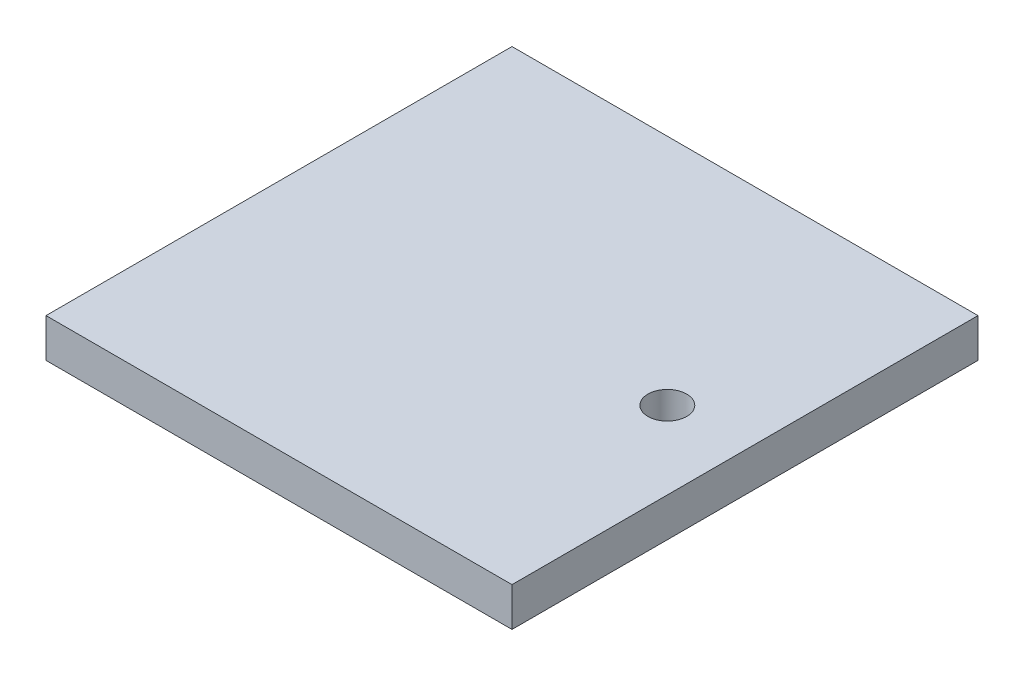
ISO-10303-21;
HEADER;
FILE_DESCRIPTION(('STEP AP214'),'2;1');
FILE_NAME('part.step','',(''),(''),'','','');
FILE_SCHEMA(('AUTOMOTIVE_DESIGN { 1 0 10303 214 1 1 1 1 }'));
ENDSEC;
DATA;
#1=APPLICATION_CONTEXT('core data for automotive mechanical design processes');
#2=APPLICATION_PROTOCOL_DEFINITION('international standard','automotive_design',2000,#1);
#3=PRODUCT_CONTEXT('',#1,'mechanical');
#4=PRODUCT('Part','Part','',(#3));
#5=PRODUCT_RELATED_PRODUCT_CATEGORY('part','',(#4));
#6=PRODUCT_DEFINITION_FORMATION('','',#4);
#7=PRODUCT_DEFINITION_CONTEXT('part definition',#1,'design');
#8=PRODUCT_DEFINITION('design','',#6,#7);
#9=PRODUCT_DEFINITION_SHAPE('','',#8);
#10=(LENGTH_UNIT() NAMED_UNIT(*) SI_UNIT(.MILLI.,.METRE.));
#11=(NAMED_UNIT(*) PLANE_ANGLE_UNIT() SI_UNIT($,.RADIAN.));
#12=(NAMED_UNIT(*) SI_UNIT($,.STERADIAN.) SOLID_ANGLE_UNIT());
#13=UNCERTAINTY_MEASURE_WITH_UNIT(LENGTH_MEASURE(1.E-05),#10,'distance_accuracy_value','');
#14=(GEOMETRIC_REPRESENTATION_CONTEXT(3) GLOBAL_UNCERTAINTY_ASSIGNED_CONTEXT((#13)) GLOBAL_UNIT_ASSIGNED_CONTEXT((#10,
#11,#12)) REPRESENTATION_CONTEXT('',''));
#15=CARTESIAN_POINT('',(0.,0.,0.));
#16=DIRECTION('',(0.,0.,1.));
#17=DIRECTION('',(1.,0.,0.));
#18=AXIS2_PLACEMENT_3D('',#15,#16,#17);
#19=CARTESIAN_POINT('',(-35.5740420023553,6.35,13.4217081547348));
#20=DIRECTION('',(0.,1.,0.));
#21=DIRECTION('',(0.,0.,1.));
#22=AXIS2_PLACEMENT_3D('',#19,#20,#21);
#23=PLANE('',#22);
#24=DIRECTION('',(0.,0.,1.));
#25=VECTOR('',#24,1.);
#26=CARTESIAN_POINT('',(-35.5740420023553,6.35,-62.7782918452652));
#27=LINE('',#26,#25);
#28=CARTESIAN_POINT('',(-35.5740420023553,6.35,-62.7782918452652));
#29=VERTEX_POINT('',#28);
#30=CARTESIAN_POINT('',(-35.5740420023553,6.35,13.4217081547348));
#31=VERTEX_POINT('',#30);
#32=EDGE_CURVE('E83',#29,#31,#27,.T.);
#33=ORIENTED_EDGE('',*,*,#32,.T.);
#34=DIRECTION('',(1.,0.,0.));
#35=VECTOR('',#34,1.);
#36=CARTESIAN_POINT('',(-35.5740420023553,6.35,13.4217081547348));
#37=LINE('',#36,#35);
#38=CARTESIAN_POINT('',(40.6259579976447,6.35,13.4217081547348));
#39=VERTEX_POINT('',#38);
#40=EDGE_CURVE('E78',#31,#39,#37,.T.);
#41=ORIENTED_EDGE('',*,*,#40,.T.);
#42=DIRECTION('',(0.,0.,-1.));
#43=VECTOR('',#42,1.);
#44=CARTESIAN_POINT('',(40.6259579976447,6.35,-62.7782918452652));
#45=LINE('',#44,#43);
#46=CARTESIAN_POINT('',(40.6259579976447,6.35,-62.7782918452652));
#47=VERTEX_POINT('',#46);
#48=EDGE_CURVE('E81',#39,#47,#45,.T.);
#49=ORIENTED_EDGE('',*,*,#48,.T.);
#50=DIRECTION('',(-1.,0.,0.));
#51=VECTOR('',#50,1.);
#52=CARTESIAN_POINT('',(-35.5740420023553,6.35,-62.7782918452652));
#53=LINE('',#52,#51);
#54=EDGE_CURVE('E48',#47,#29,#53,.T.);
#55=ORIENTED_EDGE('',*,*,#54,.T.);
#56=EDGE_LOOP('',(#33,#41,#49,#55));
#57=FACE_BOUND('',#56,.T.);
#58=CARTESIAN_POINT('',(27.9259579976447,6.35,-24.6782918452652));
#59=DIRECTION('',(0.,1.,0.));
#60=DIRECTION('',(0.,0.,1.));
#61=AXIS2_PLACEMENT_3D('',#58,#59,#60);
#62=CIRCLE('',#61,3.175);
#63=CARTESIAN_POINT('',(27.9259579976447,6.35,-21.5032918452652));
#64=VERTEX_POINT('',#63);
#65=EDGE_CURVE('E98',#64,#64,#62,.T.);
#66=ORIENTED_EDGE('',*,*,#65,.F.);
#67=EDGE_LOOP('',(#66));
#68=FACE_BOUND('',#67,.T.);
#69=ADVANCED_FACE('F31',(#57,#68),#23,.T.);
#70=CARTESIAN_POINT('',(-35.5740420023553,0.,13.4217081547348));
#71=DIRECTION('',(0.,1.,0.));
#72=DIRECTION('',(0.,0.,1.));
#73=AXIS2_PLACEMENT_3D('',#70,#71,#72);
#74=PLANE('',#73);
#75=DIRECTION('',(0.,0.,1.));
#76=VECTOR('',#75,1.);
#77=CARTESIAN_POINT('',(-35.5740420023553,0.,-62.7782918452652));
#78=LINE('',#77,#76);
#79=CARTESIAN_POINT('',(-35.5740420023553,0.,-62.7782918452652));
#80=VERTEX_POINT('',#79);
#81=CARTESIAN_POINT('',(-35.5740420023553,0.,13.4217081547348));
#82=VERTEX_POINT('',#81);
#83=EDGE_CURVE('E95',#80,#82,#78,.T.);
#84=ORIENTED_EDGE('',*,*,#83,.F.);
#85=DIRECTION('',(-1.,0.,0.));
#86=VECTOR('',#85,1.);
#87=CARTESIAN_POINT('',(-35.5740420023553,0.,-62.7782918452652));
#88=LINE('',#87,#86);
#89=CARTESIAN_POINT('',(40.6259579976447,0.,-62.7782918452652));
#90=VERTEX_POINT('',#89);
#91=EDGE_CURVE('E71',#90,#80,#88,.T.);
#92=ORIENTED_EDGE('',*,*,#91,.F.);
#93=DIRECTION('',(0.,0.,-1.));
#94=VECTOR('',#93,1.);
#95=CARTESIAN_POINT('',(40.6259579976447,0.,-62.7782918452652));
#96=LINE('',#95,#94);
#97=CARTESIAN_POINT('',(40.6259579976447,0.,13.4217081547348));
#98=VERTEX_POINT('',#97);
#99=EDGE_CURVE('E65',#98,#90,#96,.T.);
#100=ORIENTED_EDGE('',*,*,#99,.F.);
#101=DIRECTION('',(1.,0.,0.));
#102=VECTOR('',#101,1.);
#103=CARTESIAN_POINT('',(-35.5740420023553,0.,13.4217081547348));
#104=LINE('',#103,#102);
#105=EDGE_CURVE('E87',#82,#98,#104,.T.);
#106=ORIENTED_EDGE('',*,*,#105,.F.);
#107=EDGE_LOOP('',(#84,#92,#100,#106));
#108=FACE_BOUND('',#107,.T.);
#109=CARTESIAN_POINT('',(27.9259579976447,0.,-24.6782918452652));
#110=DIRECTION('',(0.,1.,0.));
#111=DIRECTION('',(0.,0.,1.));
#112=AXIS2_PLACEMENT_3D('',#109,#110,#111);
#113=CIRCLE('',#112,3.175);
#114=CARTESIAN_POINT('',(27.9259579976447,0.,-21.5032918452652));
#115=VERTEX_POINT('',#114);
#116=EDGE_CURVE('E110',#115,#115,#113,.T.);
#117=ORIENTED_EDGE('',*,*,#116,.T.);
#118=EDGE_LOOP('',(#117));
#119=FACE_BOUND('',#118,.T.);
#120=ADVANCED_FACE('F106',(#108,#119),#74,.F.);
#121=CARTESIAN_POINT('',(-35.5740420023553,6.35,-62.7782918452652));
#122=DIRECTION('',(1.,0.,0.));
#123=DIRECTION('',(0.,0.,-1.));
#124=AXIS2_PLACEMENT_3D('',#121,#122,#123);
#125=PLANE('',#124);
#126=ORIENTED_EDGE('',*,*,#83,.T.);
#127=DIRECTION('',(0.,-1.,0.));
#128=VECTOR('',#127,1.);
#129=CARTESIAN_POINT('',(-35.5740420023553,6.35,13.4217081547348));
#130=LINE('',#129,#128);
#131=EDGE_CURVE('E11',#31,#82,#130,.T.);
#132=ORIENTED_EDGE('',*,*,#131,.F.);
#133=ORIENTED_EDGE('',*,*,#32,.F.);
#134=DIRECTION('',(0.,-1.,0.));
#135=VECTOR('',#134,1.);
#136=CARTESIAN_POINT('',(-35.5740420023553,6.35,-62.7782918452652));
#137=LINE('',#136,#135);
#138=EDGE_CURVE('E91',#29,#80,#137,.T.);
#139=ORIENTED_EDGE('',*,*,#138,.T.);
#140=EDGE_LOOP('',(#126,#132,#133,#139));
#141=FACE_BOUND('',#140,.T.);
#142=ADVANCED_FACE('F33',(#141),#125,.F.);
#143=CARTESIAN_POINT('',(-35.5740420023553,6.35,13.4217081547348));
#144=DIRECTION('',(0.,0.,-1.));
#145=DIRECTION('',(-1.,0.,0.));
#146=AXIS2_PLACEMENT_3D('',#143,#144,#145);
#147=PLANE('',#146);
#148=ORIENTED_EDGE('',*,*,#105,.T.);
#149=DIRECTION('',(0.,-1.,0.));
#150=VECTOR('',#149,1.);
#151=CARTESIAN_POINT('',(40.6259579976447,6.35,13.4217081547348));
#152=LINE('',#151,#150);
#153=EDGE_CURVE('E40',#39,#98,#152,.T.);
#154=ORIENTED_EDGE('',*,*,#153,.F.);
#155=ORIENTED_EDGE('',*,*,#40,.F.);
#156=ORIENTED_EDGE('',*,*,#131,.T.);
#157=EDGE_LOOP('',(#148,#154,#155,#156));
#158=FACE_BOUND('',#157,.T.);
#159=ADVANCED_FACE('F86',(#158),#147,.F.);
#160=CARTESIAN_POINT('',(40.6259579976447,6.35,-62.7782918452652));
#161=DIRECTION('',(-1.,0.,0.));
#162=DIRECTION('',(0.,0.,1.));
#163=AXIS2_PLACEMENT_3D('',#160,#161,#162);
#164=PLANE('',#163);
#165=ORIENTED_EDGE('',*,*,#99,.T.);
#166=DIRECTION('',(0.,-1.,0.));
#167=VECTOR('',#166,1.);
#168=CARTESIAN_POINT('',(40.6259579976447,6.35,-62.7782918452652));
#169=LINE('',#168,#167);
#170=EDGE_CURVE('E88',#47,#90,#169,.T.);
#171=ORIENTED_EDGE('',*,*,#170,.F.);
#172=ORIENTED_EDGE('',*,*,#48,.F.);
#173=ORIENTED_EDGE('',*,*,#153,.T.);
#174=EDGE_LOOP('',(#165,#171,#172,#173));
#175=FACE_BOUND('',#174,.T.);
#176=ADVANCED_FACE('F89',(#175),#164,.F.);
#177=CARTESIAN_POINT('',(-35.5740420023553,6.35,-62.7782918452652));
#178=DIRECTION('',(0.,0.,1.));
#179=DIRECTION('',(1.,0.,0.));
#180=AXIS2_PLACEMENT_3D('',#177,#178,#179);
#181=PLANE('',#180);
#182=ORIENTED_EDGE('',*,*,#91,.T.);
#183=ORIENTED_EDGE('',*,*,#138,.F.);
#184=ORIENTED_EDGE('',*,*,#54,.F.);
#185=ORIENTED_EDGE('',*,*,#170,.T.);
#186=EDGE_LOOP('',(#182,#183,#184,#185));
#187=FACE_BOUND('',#186,.T.);
#188=ADVANCED_FACE('F103',(#187),#181,.F.);
#189=CARTESIAN_POINT('',(27.9259579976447,6.35,-24.6782918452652));
#190=DIRECTION('',(0.,-1.,0.));
#191=DIRECTION('',(0.,0.,-1.));
#192=AXIS2_PLACEMENT_3D('',#189,#190,#191);
#193=CYLINDRICAL_SURFACE('',#192,3.175);
#194=ORIENTED_EDGE('',*,*,#65,.T.);
#195=EDGE_LOOP('',(#194));
#196=FACE_BOUND('',#195,.T.);
#197=ORIENTED_EDGE('',*,*,#116,.F.);
#198=EDGE_LOOP('',(#197));
#199=FACE_BOUND('',#198,.T.);
#200=ADVANCED_FACE('F116',(#196,#199),#193,.F.);
#201=CLOSED_SHELL('',(#69,#120,#142,#159,#176,#188,#200));
#202=MANIFOLD_SOLID_BREP('B2',#201);
#203=ADVANCED_BREP_SHAPE_REPRESENTATION('',(#18,#202),#14);
#204=SHAPE_DEFINITION_REPRESENTATION(#9,#203);
ENDSEC;
END-ISO-10303-21;
